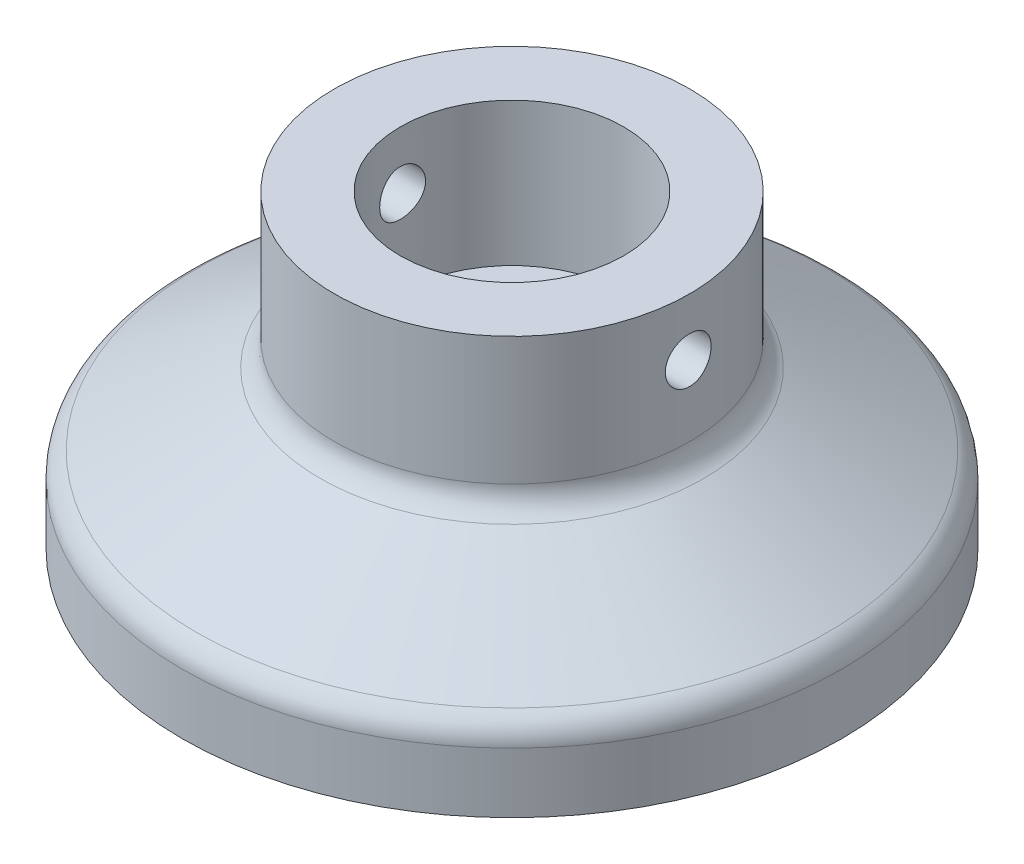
from build123d import *

# Parameters (mm, degrees)
CUT_EXTRUDE2_DEPTH      = 98.614035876
CUT_EXTRUDE2_DEPTH_BACK = 98.614035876
SKETCH3_R               = 4
FILLET2_R               = 5


with BuildPart() as part:
    # Sketch1 → Revolve2 (revolve)
    with BuildSketch(Plane.XY, mode=Mode.PRIVATE) as revolve2_sk:
        Polygon((0, 29), (19.5, 29), (19.5, 54), (31, 54), (31, 28.797173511), (57.5, 13.378991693), (57.5, 0), (47.5, 0), (47.5, 3), (20, 19), (0, 19), align=None)
    revolve(revolve2_sk.sketch.rotate(Axis((0, 0, 0), (0, 1, 0)), 90), axis=Axis((0, 0, 0), (0, 1, 0)))

    # Sketch3 → Cut-Extrude2 (cut, two sides: drawn at the far end of the back side and taken through both)
    with BuildSketch(Plane(origin=(0, 0, 0), x_dir=(0, 0, -1), z_dir=(1, 0, 0)).offset(-CUT_EXTRUDE2_DEPTH_BACK)):
        with Locations((0, 44)):
            Circle(SKETCH3_R)
    extrude(amount=CUT_EXTRUDE2_DEPTH + CUT_EXTRUDE2_DEPTH_BACK, mode=Mode.SUBTRACT)

    # Fillet2
    fillet2_edges = [part.edges().sort_by_distance(p)[0] for p in [
        (0, 28.797173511, 31),
        (0, 13.378991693, 57.5),
    ]]
    fillet(fillet2_edges, radius=FILLET2_R)


solid = part.part
